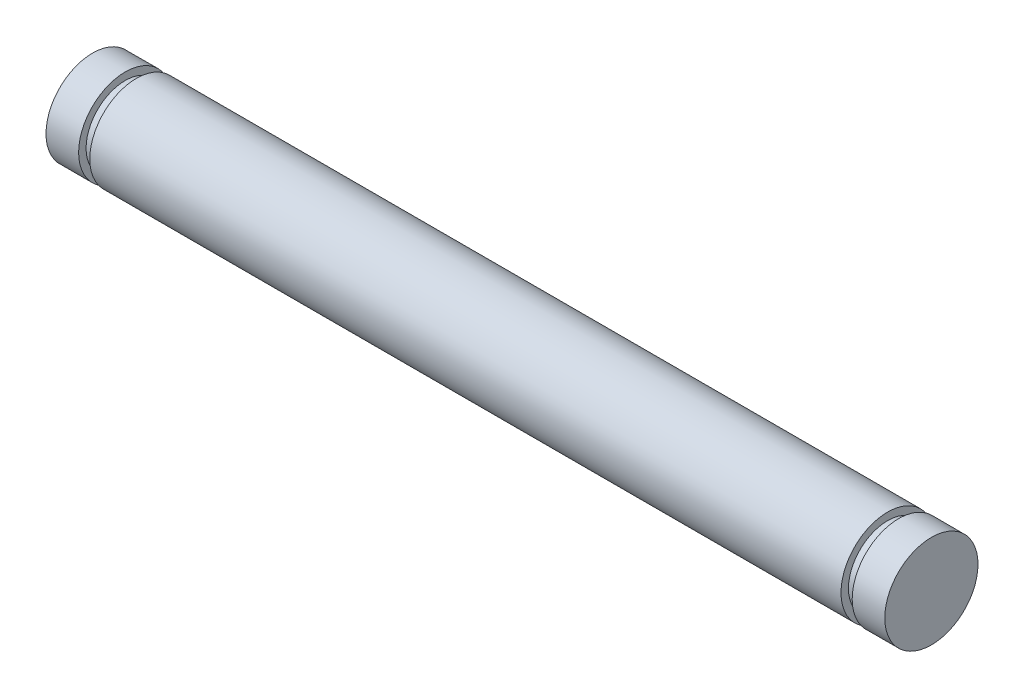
from build123d import *

# Parameters (mm, degrees)
SKETCH1_R           = 3.175
BOSS_EXTRUDE1_DEPTH = 57.15
SKETCH2_W           = 0.762
SKETCH2_H           = 0.508


with BuildPart() as part:
    # Sketch1 → Boss-Extrude1 (new body)
    with BuildSketch(Plane(origin=(0, 0, 0), x_dir=(0, 0, -1), z_dir=(1, 0, 0))):
        Circle(SKETCH1_R)
    extrude(amount=BOSS_EXTRUDE1_DEPTH)

    # Sketch2 → Cut-Revolve1 (revolve, cut)
    with BuildSketch(Plane(origin=(0, 0, 0), x_dir=(1, 0, 0), z_dir=(0, 1, 0)), mode=Mode.PRIVATE) as cut_revolve1_sk:
        with Locations((2.6035, 2.921)):
            Rectangle(SKETCH2_W, SKETCH2_H)
        with Locations((54.5465, 2.921)):
            Rectangle(SKETCH2_W, SKETCH2_H)
    revolve(cut_revolve1_sk.sketch.rotate(Axis((0, 0, 0), (1, 0, 0)), 180), axis=Axis((0, 0, 0), (1, 0, 0)), mode=Mode.SUBTRACT)


solid = part.part
